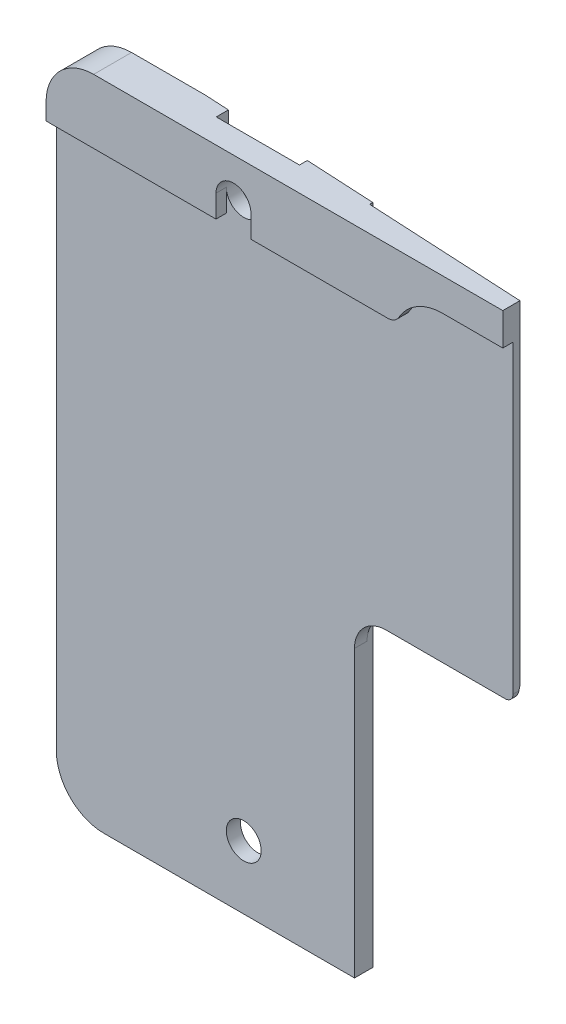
ISO-10303-21;
HEADER;
FILE_DESCRIPTION(('STEP AP214'),'2;1');
FILE_NAME('part.step','',(''),(''),'','','');
FILE_SCHEMA(('AUTOMOTIVE_DESIGN { 1 0 10303 214 1 1 1 1 }'));
ENDSEC;
DATA;
#1=APPLICATION_CONTEXT('core data for automotive mechanical design processes');
#2=APPLICATION_PROTOCOL_DEFINITION('international standard','automotive_design',2000,#1);
#3=PRODUCT_CONTEXT('',#1,'mechanical');
#4=PRODUCT('Part','Part','',(#3));
#5=PRODUCT_RELATED_PRODUCT_CATEGORY('part','',(#4));
#6=PRODUCT_DEFINITION_FORMATION('','',#4);
#7=PRODUCT_DEFINITION_CONTEXT('part definition',#1,'design');
#8=PRODUCT_DEFINITION('design','',#6,#7);
#9=PRODUCT_DEFINITION_SHAPE('','',#8);
#10=(LENGTH_UNIT() NAMED_UNIT(*) SI_UNIT(.MILLI.,.METRE.));
#11=(NAMED_UNIT(*) PLANE_ANGLE_UNIT() SI_UNIT($,.RADIAN.));
#12=(NAMED_UNIT(*) SI_UNIT($,.STERADIAN.) SOLID_ANGLE_UNIT());
#13=UNCERTAINTY_MEASURE_WITH_UNIT(LENGTH_MEASURE(1.E-05),#10,'distance_accuracy_value','');
#14=(GEOMETRIC_REPRESENTATION_CONTEXT(3) GLOBAL_UNCERTAINTY_ASSIGNED_CONTEXT((#13)) GLOBAL_UNIT_ASSIGNED_CONTEXT((#10,
#11,#12)) REPRESENTATION_CONTEXT('',''));
#15=CARTESIAN_POINT('',(0.,0.,0.));
#16=DIRECTION('',(0.,0.,1.));
#17=DIRECTION('',(1.,0.,0.));
#18=AXIS2_PLACEMENT_3D('',#15,#16,#17);
#19=CARTESIAN_POINT('',(0.,-58.4170608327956,-4.31));
#20=DIRECTION('',(0.,1.,0.));
#21=DIRECTION('',(0.,0.,1.));
#22=AXIS2_PLACEMENT_3D('',#19,#20,#21);
#23=PLANE('',#22);
#24=DIRECTION('',(1.,0.,0.));
#25=VECTOR('',#24,1.);
#26=CARTESIAN_POINT('',(0.,-58.4170608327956,-4.96));
#27=LINE('',#26,#25);
#28=CARTESIAN_POINT('',(13.115,-58.4170608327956,-4.96));
#29=VERTEX_POINT('',#28);
#30=CARTESIAN_POINT('',(21.7499385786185,-58.4170608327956,-4.96));
#31=VERTEX_POINT('',#30);
#32=EDGE_CURVE('E327',#29,#31,#27,.T.);
#33=ORIENTED_EDGE('',*,*,#32,.T.);
#34=DIRECTION('',(0.,0.,-1.));
#35=VECTOR('',#34,1.);
#36=CARTESIAN_POINT('',(21.7499385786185,-58.4170608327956,-4.31));
#37=LINE('',#36,#35);
#38=CARTESIAN_POINT('',(21.7499385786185,-58.4170608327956,-4.31));
#39=VERTEX_POINT('',#38);
#40=EDGE_CURVE('E54',#31,#39,#37,.F.);
#41=ORIENTED_EDGE('',*,*,#40,.T.);
#42=DIRECTION('',(1.,0.,0.));
#43=VECTOR('',#42,1.);
#44=CARTESIAN_POINT('',(0.,-58.4170608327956,-4.31));
#45=LINE('',#44,#43);
#46=CARTESIAN_POINT('',(13.115,-58.4170608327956,-4.31));
#47=VERTEX_POINT('',#46);
#48=EDGE_CURVE('E330',#47,#39,#45,.T.);
#49=ORIENTED_EDGE('',*,*,#48,.F.);
#50=DIRECTION('',(0.,0.,1.));
#51=VECTOR('',#50,1.);
#52=CARTESIAN_POINT('',(13.115,-58.4170608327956,-8.30299195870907));
#53=LINE('',#52,#51);
#54=EDGE_CURVE('E522',#29,#47,#53,.T.);
#55=ORIENTED_EDGE('',*,*,#54,.F.);
#56=EDGE_LOOP('',(#33,#41,#49,#55));
#57=FACE_BOUND('',#56,.T.);
#58=ADVANCED_FACE('F34',(#57),#23,.F.);
#59=CARTESIAN_POINT('',(0.,-128.652153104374,-6.7));
#60=DIRECTION('',(0.,0.,-1.));
#61=DIRECTION('',(-1.,0.,0.));
#62=AXIS2_PLACEMENT_3D('',#59,#60,#61);
#63=PLANE('',#62);
#64=CARTESIAN_POINT('',(3.2,-57.3698033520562,-6.7));
#65=DIRECTION('',(0.,0.,1.));
#66=DIRECTION('',(1.,0.,0.));
#67=AXIS2_PLACEMENT_3D('',#64,#65,#66);
#68=CIRCLE('',#67,3.);
#69=CARTESIAN_POINT('',(3.2,-54.3698033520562,-6.7));
#70=VERTEX_POINT('',#69);
#71=CARTESIAN_POINT('',(0.200000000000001,-57.3698033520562,-6.7));
#72=VERTEX_POINT('',#71);
#73=EDGE_CURVE('E279',#70,#72,#68,.T.);
#74=ORIENTED_EDGE('',*,*,#73,.F.);
#75=DIRECTION('',(-1.,0.,0.));
#76=VECTOR('',#75,1.);
#77=CARTESIAN_POINT('',(3.2,-54.3698033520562,-6.7));
#78=LINE('',#77,#76);
#79=CARTESIAN_POINT('',(7.83491967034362,-54.3698033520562,-6.70000000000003));
#80=VERTEX_POINT('',#79);
#81=EDGE_CURVE('E290',#80,#70,#78,.T.);
#82=ORIENTED_EDGE('',*,*,#81,.F.);
#83=DIRECTION('',(0.,1.,0.));
#84=VECTOR('',#83,1.);
#85=CARTESIAN_POINT('',(7.8349196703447,-128.652153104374,-6.7));
#86=LINE('',#85,#84);
#87=CARTESIAN_POINT('',(7.83491967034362,-96.145,-6.70000000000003));
#88=VERTEX_POINT('',#87);
#89=EDGE_CURVE('E344',#88,#80,#86,.T.);
#90=ORIENTED_EDGE('',*,*,#89,.F.);
#91=DIRECTION('',(1.,0.,0.));
#92=VECTOR('',#91,1.);
#93=CARTESIAN_POINT('',(3.2,-96.145,-6.7));
#94=LINE('',#93,#92);
#95=CARTESIAN_POINT('',(3.2,-96.145,-6.7));
#96=VERTEX_POINT('',#95);
#97=EDGE_CURVE('E288',#96,#88,#94,.T.);
#98=ORIENTED_EDGE('',*,*,#97,.F.);
#99=CARTESIAN_POINT('',(3.2,-93.145,-6.7));
#100=DIRECTION('',(0.,0.,1.));
#101=DIRECTION('',(-1.,0.,0.));
#102=AXIS2_PLACEMENT_3D('',#99,#100,#101);
#103=CIRCLE('',#102,3.);
#104=CARTESIAN_POINT('',(0.200000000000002,-93.145,-6.7));
#105=VERTEX_POINT('',#104);
#106=EDGE_CURVE('E285',#105,#96,#103,.T.);
#107=ORIENTED_EDGE('',*,*,#106,.F.);
#108=DIRECTION('',(0.,-1.,0.));
#109=VECTOR('',#108,1.);
#110=CARTESIAN_POINT('',(0.200000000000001,-93.145,-6.7));
#111=LINE('',#110,#109);
#112=EDGE_CURVE('E282',#72,#105,#111,.T.);
#113=ORIENTED_EDGE('',*,*,#112,.F.);
#114=EDGE_LOOP('',(#74,#82,#90,#98,#107,#113));
#115=FACE_BOUND('',#114,.T.);
#116=ADVANCED_FACE('F496',(#115),#63,.T.);
#117=CARTESIAN_POINT('',(19.,-128.652153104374,-6.11486293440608));
#118=DIRECTION('',(0.0523359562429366,0.,-0.998629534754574));
#119=DIRECTION('',(-0.998629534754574,0.,-0.0523359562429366));
#120=AXIS2_PLACEMENT_3D('',#117,#118,#119);
#121=PLANE('',#120);
#122=CARTESIAN_POINT('',(12.015,-92.145,-6.48093127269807));
#123=DIRECTION('',(0.0523359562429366,0.,-0.998629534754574));
#124=DIRECTION('',(-0.998629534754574,0.,-0.0523359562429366));
#125=AXIS2_PLACEMENT_3D('',#122,#123,#124);
#126=ELLIPSE('',#125,2.62860240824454,2.625);
#127=CARTESIAN_POINT('',(9.39000000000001,-92.145,-6.61850169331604));
#128=VERTEX_POINT('',#127);
#129=EDGE_CURVE('E278',#128,#128,#126,.T.);
#130=ORIENTED_EDGE('',*,*,#129,.F.);
#131=EDGE_LOOP('',(#130));
#132=FACE_BOUND('',#131,.T.);
#133=DIRECTION('',(0.,-1.,0.));
#134=VECTOR('',#133,1.);
#135=CARTESIAN_POINT('',(14.64,-128.652153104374,-6.34336085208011));
#136=LINE('',#135,#134);
#137=CARTESIAN_POINT('',(14.64,-54.3698033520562,-6.34336085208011));
#138=VERTEX_POINT('',#137);
#139=CARTESIAN_POINT('',(14.64,-57.,-6.34336085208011));
#140=VERTEX_POINT('',#139);
#141=EDGE_CURVE('E276',#138,#140,#136,.T.);
#142=ORIENTED_EDGE('',*,*,#141,.F.);
#143=DIRECTION('',(0.998629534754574,0.,0.0523359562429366));
#144=VECTOR('',#143,1.);
#145=CARTESIAN_POINT('',(19.,-54.3698033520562,-6.11486293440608));
#146=LINE('',#145,#144);
#147=CARTESIAN_POINT('',(19.,-54.3698033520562,-6.11486293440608));
#148=VERTEX_POINT('',#147);
#149=EDGE_CURVE('E320',#138,#148,#146,.T.);
#150=ORIENTED_EDGE('',*,*,#149,.T.);
#151=DIRECTION('',(0.,1.,0.));
#152=VECTOR('',#151,1.);
#153=CARTESIAN_POINT('',(19.,-128.652153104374,-6.11486293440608));
#154=LINE('',#153,#152);
#155=CARTESIAN_POINT('',(19.,-96.145,-6.11486293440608));
#156=VERTEX_POINT('',#155);
#157=EDGE_CURVE('E348',#156,#148,#154,.T.);
#158=ORIENTED_EDGE('',*,*,#157,.F.);
#159=DIRECTION('',(-0.998629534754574,0.,-0.0523359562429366));
#160=VECTOR('',#159,1.);
#161=CARTESIAN_POINT('',(19.,-96.145,-6.11486293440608));
#162=LINE('',#161,#160);
#163=EDGE_CURVE('E324',#156,#88,#162,.T.);
#164=ORIENTED_EDGE('',*,*,#163,.T.);
#165=ORIENTED_EDGE('',*,*,#89,.T.);
#166=CARTESIAN_POINT('',(9.39000000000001,-54.3698033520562,-6.61850169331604));
#167=VERTEX_POINT('',#166);
#168=EDGE_CURVE('E321',#80,#167,#146,.T.);
#169=ORIENTED_EDGE('',*,*,#168,.T.);
#170=DIRECTION('',(0.,1.,0.));
#171=VECTOR('',#170,1.);
#172=CARTESIAN_POINT('',(9.39000000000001,-128.652153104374,-6.61850169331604));
#173=LINE('',#172,#171);
#174=CARTESIAN_POINT('',(9.39000000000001,-57.,-6.61850169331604));
#175=VERTEX_POINT('',#174);
#176=EDGE_CURVE('E254',#175,#167,#173,.T.);
#177=ORIENTED_EDGE('',*,*,#176,.F.);
#178=CARTESIAN_POINT('',(12.015,-57.,-6.48093127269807));
#179=DIRECTION('',(0.0523359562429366,0.,-0.998629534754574));
#180=DIRECTION('',(-0.998629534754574,0.,-0.0523359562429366));
#181=AXIS2_PLACEMENT_3D('',#178,#179,#180);
#182=ELLIPSE('',#181,2.62860240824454,2.625);
#183=EDGE_CURVE('E570',#140,#175,#182,.T.);
#184=ORIENTED_EDGE('',*,*,#183,.F.);
#185=EDGE_LOOP('',(#142,#150,#158,#164,#165,#169,#177,#184));
#186=FACE_BOUND('',#185,.T.);
#187=ADVANCED_FACE('F501',(#132,#186),#121,.T.);
#188=CARTESIAN_POINT('',(19.,-128.652153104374,-6.11486293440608));
#189=DIRECTION('',(1.,0.,0.));
#190=DIRECTION('',(0.,0.,-1.));
#191=AXIS2_PLACEMENT_3D('',#188,#189,#190);
#192=PLANE('',#191);
#193=DIRECTION('',(0.,1.,0.));
#194=VECTOR('',#193,1.);
#195=CARTESIAN_POINT('',(19.,-128.652153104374,-5.9145884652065));
#196=LINE('',#195,#194);
#197=CARTESIAN_POINT('',(19.,-76.2739600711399,-5.9145884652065));
#198=VERTEX_POINT('',#197);
#199=CARTESIAN_POINT('',(19.,-54.3698033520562,-5.9145884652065));
#200=VERTEX_POINT('',#199);
#201=EDGE_CURVE('E351',#198,#200,#196,.T.);
#202=ORIENTED_EDGE('',*,*,#201,.F.);
#203=CARTESIAN_POINT('',(19.,-78.1450000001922,-5.75343244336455));
#204=CARTESIAN_POINT('',(19.0000017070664,-78.1188909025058,-5.75343222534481));
#205=CARTESIAN_POINT('',(19.0000035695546,-78.0927818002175,-5.75353385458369));
#206=CARTESIAN_POINT('',(19.0000057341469,-78.0405902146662,-5.75394079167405));
#207=CARTESIAN_POINT('',(19.0000060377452,-78.0145077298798,-5.7542459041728));
#208=CARTESIAN_POINT('',(19.0000032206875,-77.9622888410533,-5.75506068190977));
#209=CARTESIAN_POINT('',(19.0000000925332,-77.9361524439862,-5.75557079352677));
#210=CARTESIAN_POINT('',(18.9999999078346,-77.8839882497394,-5.75679027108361));
#211=CARTESIAN_POINT('',(19.0000028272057,-77.8579604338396,-5.75749883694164));
#212=CARTESIAN_POINT('',(19.0000055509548,-77.8058697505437,-5.75911818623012));
#213=CARTESIAN_POINT('',(19.0000053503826,-77.779806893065,-5.76002928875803));
#214=CARTESIAN_POINT('',(19.0000026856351,-77.7275737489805,-5.76205566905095));
#215=CARTESIAN_POINT('',(19.0000002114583,-77.7014034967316,-5.76317183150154));
#216=CARTESIAN_POINT('',(18.9999997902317,-77.6492813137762,-5.76559232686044));
#217=CARTESIAN_POINT('',(19.0000018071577,-77.623329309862,-5.7668950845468));
#218=CARTESIAN_POINT('',(19.0000036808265,-77.5713316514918,-5.76970012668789));
#219=CARTESIAN_POINT('',(19.0000035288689,-77.5452860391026,-5.77120319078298));
#220=CARTESIAN_POINT('',(19.0000017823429,-77.4930425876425,-5.77441186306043));
#221=CARTESIAN_POINT('',(19.0000001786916,-77.4668448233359,-5.7761186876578));
#222=CARTESIAN_POINT('',(18.9999998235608,-77.4147925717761,-5.77970025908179));
#223=CARTESIAN_POINT('',(19.0000010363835,-77.3889379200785,-5.78157261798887));
#224=CARTESIAN_POINT('',(19.0000021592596,-77.3370660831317,-5.78551386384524));
#225=CARTESIAN_POINT('',(19.000002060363,-77.3110489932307,-5.78758400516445));
#226=CARTESIAN_POINT('',(19.0000010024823,-77.2588082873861,-5.79192416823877));
#227=CARTESIAN_POINT('',(19.0000000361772,-77.2325848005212,-5.79419574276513));
#228=CARTESIAN_POINT('',(18.9999999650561,-77.1810476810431,-5.79883789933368));
#229=CARTESIAN_POINT('',(19.000000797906,-77.1557335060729,-5.80120246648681));
#230=CARTESIAN_POINT('',(19.000002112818,-77.1048872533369,-5.80611764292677));
#231=CARTESIAN_POINT('',(19.0000025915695,-77.0793553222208,-5.80866976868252));
#232=CARTESIAN_POINT('',(19.000002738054,-77.0280438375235,-5.8139630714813));
#233=CARTESIAN_POINT('',(19.0000023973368,-77.002264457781,-5.81670593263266));
#234=CARTESIAN_POINT('',(19.0000016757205,-76.9504309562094,-5.82238360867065));
#235=CARTESIAN_POINT('',(19.0000012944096,-76.9243770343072,-5.82532024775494));
#236=CARTESIAN_POINT('',(19.0000006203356,-76.8719694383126,-5.83138836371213));
#237=CARTESIAN_POINT('',(19.0000003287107,-76.8456159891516,-5.83452178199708));
#238=CARTESIAN_POINT('',(19.0000002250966,-76.7925863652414,-5.84098611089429));
#239=CARTESIAN_POINT('',(19.0000004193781,-76.7659104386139,-5.84431905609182));
#240=CARTESIAN_POINT('',(18.9999996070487,-76.7142586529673,-5.85092422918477));
#241=CARTESIAN_POINT('',(18.9999986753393,-76.6892815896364,-5.85418704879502));
#242=CARTESIAN_POINT('',(18.999996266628,-76.6389958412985,-5.86088940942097));
#243=CARTESIAN_POINT('',(18.9999947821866,-76.6136874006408,-5.86433078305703));
#244=CARTESIAN_POINT('',(18.9999927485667,-76.5627247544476,-5.87139206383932));
#245=CARTESIAN_POINT('',(18.9999922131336,-76.5370708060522,-5.87501382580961));
#246=CARTESIAN_POINT('',(18.9999922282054,-76.4854043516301,-5.88243776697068));
#247=CARTESIAN_POINT('',(18.9999927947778,-76.4593921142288,-5.88624181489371));
#248=CARTESIAN_POINT('',(18.999994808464,-76.4069978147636,-5.89403207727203));
#249=CARTESIAN_POINT('',(18.9999962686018,-76.380616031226,-5.89802016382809));
#250=CARTESIAN_POINT('',(18.9999987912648,-76.3274728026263,-5.90618027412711));
#251=CARTESIAN_POINT('',(18.9999998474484,-76.3007116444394,-5.91035416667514));
#252=CARTESIAN_POINT('',(19.0000000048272,-76.2739600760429,-5.91458846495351));
#253=B_SPLINE_CURVE_WITH_KNOTS('',3,(#203,#204,#205,#206,#207,#208,#209,#210,#211,#212,#213,
#214,#215,#216,#217,#218,#219,#220,#221,#222,#223,#224,#225,#226,#227,#228,#229,#230,#231,#232,
#233,#234,#235,#236,#237,#238,#239,#240,#241,#242,#243,#244,#245,#246,#247,#248,#249,#250,#251,
#252),.UNSPECIFIED.,.F.,.F.,(4,2,2,2,2,2,2,2,2,2,2,2,2,2,2,2,2,2,2,2,2,2,2,2,4),(0.,
0.0783271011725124,0.156579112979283,0.235002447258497,0.313114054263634,0.391349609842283,
0.469930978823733,0.547884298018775,0.626150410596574,0.704909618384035,0.782676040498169,
0.860973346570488,0.939937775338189,1.01621034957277,1.09318731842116,1.17096146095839,
1.24961765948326,1.32923440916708,1.40988393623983,1.48545141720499,1.56207510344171,
1.63979980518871,1.71866624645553,1.79871050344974,1.87996428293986),.UNSPECIFIED.);
#254=CARTESIAN_POINT('',(19.,-78.145,-5.75343169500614));
#255=VERTEX_POINT('',#254);
#256=EDGE_CURVE('E425',#198,#255,#253,.F.);
#257=ORIENTED_EDGE('',*,*,#256,.T.);
#258=DIRECTION('',(0.,0.,1.));
#259=VECTOR('',#258,1.);
#260=CARTESIAN_POINT('',(19.,-78.145,-4.96));
#261=LINE('',#260,#259);
#262=CARTESIAN_POINT('',(19.,-78.145,-4.96));
#263=VERTEX_POINT('',#262);
#264=EDGE_CURVE('E581',#255,#263,#261,.T.);
#265=ORIENTED_EDGE('',*,*,#264,.T.);
#266=DIRECTION('',(0.,1.,0.));
#267=VECTOR('',#266,1.);
#268=CARTESIAN_POINT('',(19.,-128.652153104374,-4.96));
#269=LINE('',#268,#267);
#270=CARTESIAN_POINT('',(19.,-96.145,-4.96));
#271=VERTEX_POINT('',#270);
#272=EDGE_CURVE('E571',#271,#263,#269,.T.);
#273=ORIENTED_EDGE('',*,*,#272,.F.);
#274=DIRECTION('',(0.,0.,1.));
#275=VECTOR('',#274,1.);
#276=CARTESIAN_POINT('',(19.,-96.145,-6.7));
#277=LINE('',#276,#275);
#278=EDGE_CURVE('E300',#156,#271,#277,.T.);
#279=ORIENTED_EDGE('',*,*,#278,.F.);
#280=ORIENTED_EDGE('',*,*,#157,.T.);
#281=DIRECTION('',(0.,0.,1.));
#282=VECTOR('',#281,1.);
#283=CARTESIAN_POINT('',(19.,-54.3698033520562,-6.11486293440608));
#284=LINE('',#283,#282);
#285=EDGE_CURVE('E317',#148,#200,#284,.T.);
#286=ORIENTED_EDGE('',*,*,#285,.T.);
#287=EDGE_LOOP('',(#202,#257,#265,#273,#279,#280,#286));
#288=FACE_BOUND('',#287,.T.);
#289=ADVANCED_FACE('F384',(#288),#192,.T.);
#290=CARTESIAN_POINT('',(19.,-128.652153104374,-5.9145884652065));
#291=DIRECTION('',(0.0523359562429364,0.,-0.998629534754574));
#292=DIRECTION('',(-0.998629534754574,0.,-0.0523359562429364));
#293=AXIS2_PLACEMENT_3D('',#290,#291,#292);
#294=PLANE('',#293);
#295=DIRECTION('',(-0.998629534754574,0.,-0.0523359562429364));
#296=VECTOR('',#295,1.);
#297=CARTESIAN_POINT('',(19.,-75.3985898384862,-5.9145884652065));
#298=LINE('',#297,#296);
#299=CARTESIAN_POINT('',(29.,-75.3985898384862,-5.39051067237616));
#300=VERTEX_POINT('',#299);
#301=CARTESIAN_POINT('',(21.0104671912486,-75.3985898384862,-5.80922434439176));
#302=VERTEX_POINT('',#301);
#303=EDGE_CURVE('E371',#300,#302,#298,.T.);
#304=ORIENTED_EDGE('',*,*,#303,.T.);
#305=CARTESIAN_POINT('',(18.2725232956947,-78.3604808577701,-5.95271390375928));
#306=CARTESIAN_POINT('',(18.2577001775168,-78.172322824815,-5.95349075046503));
#307=CARTESIAN_POINT('',(18.2623719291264,-77.9826397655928,-5.95324591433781));
#308=CARTESIAN_POINT('',(18.2984056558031,-77.701831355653,-5.95135746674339));
#309=CARTESIAN_POINT('',(18.3152460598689,-77.6088493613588,-5.95047489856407));
#310=CARTESIAN_POINT('',(18.358405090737,-77.4251103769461,-5.94821302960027));
#311=CARTESIAN_POINT('',(18.3847238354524,-77.3343544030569,-5.94683372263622));
#312=CARTESIAN_POINT('',(18.4465606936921,-77.1560318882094,-5.94359299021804));
#313=CARTESIAN_POINT('',(18.482078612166,-77.068465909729,-5.94173157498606));
#314=CARTESIAN_POINT('',(18.5619367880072,-76.8974530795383,-5.93754638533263));
#315=CARTESIAN_POINT('',(18.60627679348,-76.8140067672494,-5.93522262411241));
#316=CARTESIAN_POINT('',(18.7033084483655,-76.6521192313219,-5.9301374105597));
#317=CARTESIAN_POINT('',(18.7559997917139,-76.5736785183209,-5.92737597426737));
#318=CARTESIAN_POINT('',(18.869174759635,-76.4226350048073,-5.92144472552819));
#319=CARTESIAN_POINT('',(18.929658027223,-76.3500326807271,-5.91827493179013));
#320=CARTESIAN_POINT('',(19.0577747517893,-76.2114367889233,-5.91156061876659));
#321=CARTESIAN_POINT('',(19.1254078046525,-76.145443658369,-5.9080161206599));
#322=CARTESIAN_POINT('',(19.2671060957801,-76.0207668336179,-5.9005900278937));
#323=CARTESIAN_POINT('',(19.3411708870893,-75.9620835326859,-5.89670845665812));
#324=CARTESIAN_POINT('',(19.4949463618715,-75.8526494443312,-5.8886494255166));
#325=CARTESIAN_POINT('',(19.5746565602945,-75.8018990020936,-5.88447199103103));
#326=CARTESIAN_POINT('',(19.7388766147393,-75.7088694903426,-5.87586558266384));
#327=CARTESIAN_POINT('',(19.8233859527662,-75.6665907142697,-5.87143663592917));
#328=CARTESIAN_POINT('',(19.9963070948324,-75.5909534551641,-5.8623742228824));
#329=CARTESIAN_POINT('',(20.0847183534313,-75.557595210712,-5.85774078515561));
#330=CARTESIAN_POINT('',(20.2645047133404,-75.5001532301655,-5.8483185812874));
#331=CARTESIAN_POINT('',(20.3558787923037,-75.4760694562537,-5.8435298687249));
#332=CARTESIAN_POINT('',(20.632994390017,-75.4181148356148,-5.82900685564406));
#333=CARTESIAN_POINT('',(20.8217261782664,-75.3985751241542,-5.81911584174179));
#334=CARTESIAN_POINT('',(21.0104671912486,-75.3985898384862,-5.80922434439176));
#335=B_SPLINE_CURVE_WITH_KNOTS('',3,(#305,#306,#307,#308,#309,#310,#311,#312,#313,#314,#315,
#316,#317,#318,#319,#320,#321,#322,#323,#324,#325,#326,#327,#328,#329,#330,#331,#332,#333,#334),
.UNSPECIFIED.,.F.,.F.,(4,2,2,2,2,2,2,2,2,2,2,2,2,2,4),(-0.0785398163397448,0.127627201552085,
0.230710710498,0.333794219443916,0.436877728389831,0.539961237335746,0.643044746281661,
0.746128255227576,0.849211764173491,0.952295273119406,1.05537878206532,1.15846229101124,
1.26154579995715,1.36462930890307,1.5707963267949),.UNSPECIFIED.);
#336=EDGE_CURVE('E365',#302,#198,#335,.F.);
#337=ORIENTED_EDGE('',*,*,#336,.T.);
#338=ORIENTED_EDGE('',*,*,#201,.T.);
#339=DIRECTION('',(0.998629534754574,0.,0.0523359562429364));
#340=VECTOR('',#339,1.);
#341=CARTESIAN_POINT('',(19.,-54.3698033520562,-5.9145884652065));
#342=LINE('',#341,#340);
#343=CARTESIAN_POINT('',(29.,-54.3698033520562,-5.39051067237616));
#344=VERTEX_POINT('',#343);
#345=EDGE_CURVE('E314',#200,#344,#342,.T.);
#346=ORIENTED_EDGE('',*,*,#345,.T.);
#347=DIRECTION('',(0.,1.,0.));
#348=VECTOR('',#347,1.);
#349=CARTESIAN_POINT('',(29.,-128.652153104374,-5.39051067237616));
#350=LINE('',#349,#348);
#351=EDGE_CURVE('E354',#300,#344,#350,.T.);
#352=ORIENTED_EDGE('',*,*,#351,.F.);
#353=EDGE_LOOP('',(#304,#337,#338,#346,#352));
#354=FACE_BOUND('',#353,.T.);
#355=ADVANCED_FACE('F373',(#354),#294,.T.);
#356=CARTESIAN_POINT('',(29.,-128.652153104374,-4.96));
#357=DIRECTION('',(1.,0.,0.));
#358=DIRECTION('',(0.,0.,-1.));
#359=AXIS2_PLACEMENT_3D('',#356,#357,#358);
#360=PLANE('',#359);
#361=DIRECTION('',(0.,1.,0.));
#362=VECTOR('',#361,1.);
#363=CARTESIAN_POINT('',(29.,-128.652153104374,-4.96));
#364=LINE('',#363,#362);
#365=CARTESIAN_POINT('',(29.,-75.645,-4.96));
#366=VERTEX_POINT('',#365);
#367=CARTESIAN_POINT('',(29.,-56.4170608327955,-4.96));
#368=VERTEX_POINT('',#367);
#369=EDGE_CURVE('E343',#366,#368,#364,.T.);
#370=ORIENTED_EDGE('',*,*,#369,.F.);
#371=DIRECTION('',(0.,0.,1.));
#372=VECTOR('',#371,1.);
#373=CARTESIAN_POINT('',(29.,-75.645,-4.96));
#374=LINE('',#373,#372);
#375=CARTESIAN_POINT('',(29.,-75.645,-5.32439465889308));
#376=VERTEX_POINT('',#375);
#377=EDGE_CURVE('E544',#366,#376,#374,.F.);
#378=ORIENTED_EDGE('',*,*,#377,.T.);
#379=DIRECTION('',(0.,-0.965836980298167,0.259150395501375));
#380=VECTOR('',#379,1.);
#381=CARTESIAN_POINT('',(29.,-125.183456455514,7.96761097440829));
#382=LINE('',#381,#380);
#383=EDGE_CURVE('E420',#376,#300,#382,.F.);
#384=ORIENTED_EDGE('',*,*,#383,.T.);
#385=ORIENTED_EDGE('',*,*,#351,.T.);
#386=DIRECTION('',(0.,0.,1.));
#387=VECTOR('',#386,1.);
#388=CARTESIAN_POINT('',(29.,-54.3698033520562,-6.7));
#389=LINE('',#388,#387);
#390=CARTESIAN_POINT('',(29.,-54.3698033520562,-4.31));
#391=VERTEX_POINT('',#390);
#392=EDGE_CURVE('E297',#344,#391,#389,.T.);
#393=ORIENTED_EDGE('',*,*,#392,.T.);
#394=DIRECTION('',(0.,1.,0.));
#395=VECTOR('',#394,1.);
#396=CARTESIAN_POINT('',(29.,-52.2,-4.31));
#397=LINE('',#396,#395);
#398=CARTESIAN_POINT('',(29.,-56.4170608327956,-4.31));
#399=VERTEX_POINT('',#398);
#400=EDGE_CURVE('E332',#399,#391,#397,.T.);
#401=ORIENTED_EDGE('',*,*,#400,.F.);
#402=DIRECTION('',(0.,0.,-1.));
#403=VECTOR('',#402,1.);
#404=CARTESIAN_POINT('',(29.,-56.4170608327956,-4.31));
#405=LINE('',#404,#403);
#406=EDGE_CURVE('E335',#399,#368,#405,.T.);
#407=ORIENTED_EDGE('',*,*,#406,.T.);
#408=EDGE_LOOP('',(#370,#378,#384,#385,#393,#401,#407));
#409=FACE_BOUND('',#408,.T.);
#410=ADVANCED_FACE('F383',(#409),#360,.T.);
#411=CARTESIAN_POINT('',(0.,-128.652153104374,-4.96));
#412=DIRECTION('',(0.,0.,1.));
#413=DIRECTION('',(1.,0.,0.));
#414=AXIS2_PLACEMENT_3D('',#411,#412,#413);
#415=PLANE('',#414);
#416=CARTESIAN_POINT('',(12.015,-92.145,-4.96));
#417=DIRECTION('',(0.,0.,1.));
#418=DIRECTION('',(1.,0.,0.));
#419=AXIS2_PLACEMENT_3D('',#416,#417,#418);
#420=CIRCLE('',#419,1.1);
#421=CARTESIAN_POINT('',(10.915,-92.145,-4.96));
#422=VERTEX_POINT('',#421);
#423=EDGE_CURVE('E238',#422,#422,#420,.T.);
#424=ORIENTED_EDGE('',*,*,#423,.F.);
#425=EDGE_LOOP('',(#424));
#426=FACE_BOUND('',#425,.T.);
#427=DIRECTION('',(1.,0.,0.));
#428=VECTOR('',#427,1.);
#429=CARTESIAN_POINT('',(22.25,-56.4170608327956,-4.96));
#430=LINE('',#429,#428);
#431=CARTESIAN_POINT('',(25.1995762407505,-56.4170608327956,-4.96));
#432=VERTEX_POINT('',#431);
#433=EDGE_CURVE('E339',#432,#368,#430,.T.);
#434=ORIENTED_EDGE('',*,*,#433,.F.);
#435=CARTESIAN_POINT('',(25.1995762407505,-59.5920608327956,-4.96));
#436=DIRECTION('',(0.,0.,1.));
#437=DIRECTION('',(1.,0.,0.));
#438=AXIS2_PLACEMENT_3D('',#435,#436,#437);
#439=CIRCLE('',#438,3.175);
#440=CARTESIAN_POINT('',(22.4442052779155,-58.0145451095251,-4.96));
#441=VERTEX_POINT('',#440);
#442=EDGE_CURVE('E537',#432,#441,#439,.T.);
#443=ORIENTED_EDGE('',*,*,#442,.T.);
#444=CARTESIAN_POINT('',(21.7499385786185,-57.6170608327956,-4.96));
#445=DIRECTION('',(0.,0.,1.));
#446=DIRECTION('',(1.,0.,0.));
#447=AXIS2_PLACEMENT_3D('',#444,#445,#446);
#448=CIRCLE('',#447,0.8);
#449=EDGE_CURVE('E12',#441,#31,#448,.F.);
#450=ORIENTED_EDGE('',*,*,#449,.T.);
#451=ORIENTED_EDGE('',*,*,#32,.F.);
#452=DIRECTION('',(0.,-1.,0.));
#453=VECTOR('',#452,1.);
#454=CARTESIAN_POINT('',(13.115,-58.4170608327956,-4.96));
#455=LINE('',#454,#453);
#456=CARTESIAN_POINT('',(13.115,-57.,-4.96));
#457=VERTEX_POINT('',#456);
#458=EDGE_CURVE('E518',#457,#29,#455,.T.);
#459=ORIENTED_EDGE('',*,*,#458,.F.);
#460=CARTESIAN_POINT('',(12.015,-57.,-4.96));
#461=DIRECTION('',(0.,0.,1.));
#462=DIRECTION('',(1.,0.,0.));
#463=AXIS2_PLACEMENT_3D('',#460,#461,#462);
#464=CIRCLE('',#463,1.1);
#465=CARTESIAN_POINT('',(10.915,-57.,-4.96));
#466=VERTEX_POINT('',#465);
#467=EDGE_CURVE('E517',#457,#466,#464,.F.);
#468=ORIENTED_EDGE('',*,*,#467,.T.);
#469=DIRECTION('',(0.,1.,0.));
#470=VECTOR('',#469,1.);
#471=CARTESIAN_POINT('',(10.915,-57.,-4.96));
#472=LINE('',#471,#470);
#473=CARTESIAN_POINT('',(10.915,-58.4170608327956,-4.96));
#474=VERTEX_POINT('',#473);
#475=EDGE_CURVE('E216',#474,#466,#472,.T.);
#476=ORIENTED_EDGE('',*,*,#475,.F.);
#477=CARTESIAN_POINT('',(0.200000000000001,-58.4170608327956,-4.96));
#478=VERTEX_POINT('',#477);
#479=EDGE_CURVE('E336',#478,#474,#27,.T.);
#480=ORIENTED_EDGE('',*,*,#479,.F.);
#481=DIRECTION('',(0.,-1.,0.));
#482=VECTOR('',#481,1.);
#483=CARTESIAN_POINT('',(0.200000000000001,-128.652153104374,-4.96));
#484=LINE('',#483,#482);
#485=CARTESIAN_POINT('',(0.200000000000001,-93.145,-4.96));
#486=VERTEX_POINT('',#485);
#487=EDGE_CURVE('E311',#478,#486,#484,.T.);
#488=ORIENTED_EDGE('',*,*,#487,.T.);
#489=CARTESIAN_POINT('',(3.2,-93.145,-4.96));
#490=DIRECTION('',(0.,0.,1.));
#491=DIRECTION('',(1.,0.,0.));
#492=AXIS2_PLACEMENT_3D('',#489,#490,#491);
#493=CIRCLE('',#492,3.);
#494=CARTESIAN_POINT('',(3.2,-96.145,-4.96));
#495=VERTEX_POINT('',#494);
#496=EDGE_CURVE('E855',#486,#495,#493,.T.);
#497=ORIENTED_EDGE('',*,*,#496,.T.);
#498=DIRECTION('',(1.,0.,0.));
#499=VECTOR('',#498,1.);
#500=CARTESIAN_POINT('',(0.,-96.145,-4.96));
#501=LINE('',#500,#499);
#502=EDGE_CURVE('E574',#495,#271,#501,.T.);
#503=ORIENTED_EDGE('',*,*,#502,.T.);
#504=ORIENTED_EDGE('',*,*,#272,.T.);
#505=CARTESIAN_POINT('',(21.,-78.145,-4.96));
#506=DIRECTION('',(0.,0.,1.));
#507=DIRECTION('',(1.,0.,0.));
#508=AXIS2_PLACEMENT_3D('',#505,#506,#507);
#509=CIRCLE('',#508,2.);
#510=CARTESIAN_POINT('',(21.,-76.145,-4.96));
#511=VERTEX_POINT('',#510);
#512=EDGE_CURVE('E359',#263,#511,#509,.F.);
#513=ORIENTED_EDGE('',*,*,#512,.T.);
#514=DIRECTION('',(1.,0.,0.));
#515=VECTOR('',#514,1.);
#516=CARTESIAN_POINT('',(0.,-76.145,-4.96));
#517=LINE('',#516,#515);
#518=CARTESIAN_POINT('',(28.5,-76.145,-4.96));
#519=VERTEX_POINT('',#518);
#520=EDGE_CURVE('E563',#511,#519,#517,.T.);
#521=ORIENTED_EDGE('',*,*,#520,.T.);
#522=CARTESIAN_POINT('',(28.5,-75.645,-4.96));
#523=DIRECTION('',(0.,0.,1.));
#524=DIRECTION('',(1.,0.,0.));
#525=AXIS2_PLACEMENT_3D('',#522,#523,#524);
#526=CIRCLE('',#525,0.5);
#527=EDGE_CURVE('E546',#519,#366,#526,.T.);
#528=ORIENTED_EDGE('',*,*,#527,.T.);
#529=ORIENTED_EDGE('',*,*,#369,.T.);
#530=EDGE_LOOP('',(#434,#443,#450,#451,#459,#468,#476,#480,#488,#497,#503,#504,#513,#521,#528,#529));
#531=FACE_BOUND('',#530,.T.);
#532=ADVANCED_FACE('F389',(#426,#531),#415,.T.);
#533=ORIENTED_EDGE('',*,*,#479,.T.);
#534=DIRECTION('',(0.,0.,1.));
#535=VECTOR('',#534,1.);
#536=CARTESIAN_POINT('',(10.915,-58.4170608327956,-8.30299195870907));
#537=LINE('',#536,#535);
#538=CARTESIAN_POINT('',(10.915,-58.4170608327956,-4.31));
#539=VERTEX_POINT('',#538);
#540=EDGE_CURVE('E220',#474,#539,#537,.T.);
#541=ORIENTED_EDGE('',*,*,#540,.T.);
#542=CARTESIAN_POINT('',(0.200000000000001,-58.4170608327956,-4.31));
#543=VERTEX_POINT('',#542);
#544=EDGE_CURVE('E231',#543,#539,#45,.T.);
#545=ORIENTED_EDGE('',*,*,#544,.F.);
#546=DIRECTION('',(0.,0.,1.));
#547=VECTOR('',#546,1.);
#548=CARTESIAN_POINT('',(0.200000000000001,-58.4170608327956,-4.31));
#549=LINE('',#548,#547);
#550=EDGE_CURVE('E296',#478,#543,#549,.T.);
#551=ORIENTED_EDGE('',*,*,#550,.F.);
#552=EDGE_LOOP('',(#533,#541,#545,#551));
#553=FACE_BOUND('',#552,.T.);
#554=ADVANCED_FACE('F393',(#553),#23,.F.);
#555=CARTESIAN_POINT('',(0.,0.,-4.31));
#556=DIRECTION('',(0.,0.,1.));
#557=DIRECTION('',(1.,0.,0.));
#558=AXIS2_PLACEMENT_3D('',#555,#556,#557);
#559=PLANE('',#558);
#560=ORIENTED_EDGE('',*,*,#48,.T.);
#561=CARTESIAN_POINT('',(21.7499385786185,-57.6170608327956,-4.31));
#562=DIRECTION('',(0.,0.,1.));
#563=DIRECTION('',(1.,0.,0.));
#564=AXIS2_PLACEMENT_3D('',#561,#562,#563);
#565=CIRCLE('',#564,0.8);
#566=CARTESIAN_POINT('',(22.4442052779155,-58.0145451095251,-4.31));
#567=VERTEX_POINT('',#566);
#568=EDGE_CURVE('E42',#39,#567,#565,.T.);
#569=ORIENTED_EDGE('',*,*,#568,.T.);
#570=CARTESIAN_POINT('',(25.1995762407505,-59.5920608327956,-4.31));
#571=DIRECTION('',(0.,0.,1.));
#572=DIRECTION('',(1.,0.,0.));
#573=AXIS2_PLACEMENT_3D('',#570,#571,#572);
#574=CIRCLE('',#573,3.175);
#575=CARTESIAN_POINT('',(25.1995762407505,-56.4170608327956,-4.31));
#576=VERTEX_POINT('',#575);
#577=EDGE_CURVE('E535',#567,#576,#574,.F.);
#578=ORIENTED_EDGE('',*,*,#577,.T.);
#579=DIRECTION('',(1.,0.,0.));
#580=VECTOR('',#579,1.);
#581=CARTESIAN_POINT('',(22.25,-56.4170608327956,-4.31));
#582=LINE('',#581,#580);
#583=EDGE_CURVE('E329',#576,#399,#582,.T.);
#584=ORIENTED_EDGE('',*,*,#583,.T.);
#585=ORIENTED_EDGE('',*,*,#400,.T.);
#586=DIRECTION('',(-1.,0.,0.));
#587=VECTOR('',#586,1.);
#588=CARTESIAN_POINT('',(0.,-54.3698033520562,-4.31));
#589=LINE('',#588,#587);
#590=CARTESIAN_POINT('',(3.2,-54.3698033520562,-4.31));
#591=VERTEX_POINT('',#590);
#592=EDGE_CURVE('E853',#391,#591,#589,.T.);
#593=ORIENTED_EDGE('',*,*,#592,.T.);
#594=CARTESIAN_POINT('',(3.2,-57.3698033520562,-4.31));
#595=DIRECTION('',(0.,0.,1.));
#596=DIRECTION('',(1.,0.,0.));
#597=AXIS2_PLACEMENT_3D('',#594,#595,#596);
#598=CIRCLE('',#597,3.);
#599=CARTESIAN_POINT('',(0.200000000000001,-57.3698033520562,-4.31));
#600=VERTEX_POINT('',#599);
#601=EDGE_CURVE('E852',#591,#600,#598,.T.);
#602=ORIENTED_EDGE('',*,*,#601,.T.);
#603=DIRECTION('',(0.,-1.,0.));
#604=VECTOR('',#603,1.);
#605=CARTESIAN_POINT('',(0.200000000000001,0.,-4.31));
#606=LINE('',#605,#604);
#607=EDGE_CURVE('E347',#600,#543,#606,.T.);
#608=ORIENTED_EDGE('',*,*,#607,.T.);
#609=ORIENTED_EDGE('',*,*,#544,.T.);
#610=DIRECTION('',(0.,-1.,0.));
#611=VECTOR('',#610,1.);
#612=CARTESIAN_POINT('',(10.915,-57.,-4.31));
#613=LINE('',#612,#611);
#614=CARTESIAN_POINT('',(10.915,-57.,-4.31));
#615=VERTEX_POINT('',#614);
#616=EDGE_CURVE('E213',#615,#539,#613,.T.);
#617=ORIENTED_EDGE('',*,*,#616,.F.);
#618=CARTESIAN_POINT('',(12.015,-57.,-4.31));
#619=DIRECTION('',(0.,0.,-1.));
#620=DIRECTION('',(-1.,0.,0.));
#621=AXIS2_PLACEMENT_3D('',#618,#619,#620);
#622=CIRCLE('',#621,1.1);
#623=CARTESIAN_POINT('',(13.115,-57.,-4.31));
#624=VERTEX_POINT('',#623);
#625=EDGE_CURVE('E228',#615,#624,#622,.T.);
#626=ORIENTED_EDGE('',*,*,#625,.T.);
#627=DIRECTION('',(0.,1.,0.));
#628=VECTOR('',#627,1.);
#629=CARTESIAN_POINT('',(13.115,-58.4170608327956,-4.31));
#630=LINE('',#629,#628);
#631=EDGE_CURVE('E221',#47,#624,#630,.T.);
#632=ORIENTED_EDGE('',*,*,#631,.F.);
#633=EDGE_LOOP('',(#560,#569,#578,#584,#585,#593,#602,#608,#609,#617,#626,#632));
#634=FACE_BOUND('',#633,.T.);
#635=ADVANCED_FACE('F226',(#634),#559,.T.);
#636=CARTESIAN_POINT('',(22.25,-56.4170608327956,-4.31));
#637=DIRECTION('',(0.,1.,0.));
#638=DIRECTION('',(0.,0.,1.));
#639=AXIS2_PLACEMENT_3D('',#636,#637,#638);
#640=PLANE('',#639);
#641=ORIENTED_EDGE('',*,*,#583,.F.);
#642=DIRECTION('',(0.,0.,-1.));
#643=VECTOR('',#642,1.);
#644=CARTESIAN_POINT('',(25.1995762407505,-56.4170608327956,-4.31));
#645=LINE('',#644,#643);
#646=EDGE_CURVE('E539',#576,#432,#645,.T.);
#647=ORIENTED_EDGE('',*,*,#646,.T.);
#648=ORIENTED_EDGE('',*,*,#433,.T.);
#649=ORIENTED_EDGE('',*,*,#406,.F.);
#650=EDGE_LOOP('',(#641,#647,#648,#649));
#651=FACE_BOUND('',#650,.T.);
#652=ADVANCED_FACE('F510',(#651),#640,.F.);
#653=CARTESIAN_POINT('',(3.2,-57.3698033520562,-6.7));
#654=DIRECTION('',(0.,0.,1.));
#655=DIRECTION('',(1.,0.,0.));
#656=AXIS2_PLACEMENT_3D('',#653,#654,#655);
#657=CYLINDRICAL_SURFACE('',#656,3.);
#658=DIRECTION('',(0.,0.,1.));
#659=VECTOR('',#658,1.);
#660=CARTESIAN_POINT('',(3.2,-54.3698033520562,-6.7));
#661=LINE('',#660,#659);
#662=EDGE_CURVE('E293',#70,#591,#661,.T.);
#663=ORIENTED_EDGE('',*,*,#662,.F.);
#664=ORIENTED_EDGE('',*,*,#73,.T.);
#665=DIRECTION('',(0.,0.,1.));
#666=VECTOR('',#665,1.);
#667=CARTESIAN_POINT('',(0.200000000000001,-57.3698033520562,-6.7));
#668=LINE('',#667,#666);
#669=EDGE_CURVE('E292',#72,#600,#668,.T.);
#670=ORIENTED_EDGE('',*,*,#669,.T.);
#671=ORIENTED_EDGE('',*,*,#601,.F.);
#672=EDGE_LOOP('',(#663,#664,#670,#671));
#673=FACE_BOUND('',#672,.T.);
#674=ADVANCED_FACE('F611',(#673),#657,.T.);
#675=CARTESIAN_POINT('',(3.2,-54.3698033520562,-6.7));
#676=DIRECTION('',(0.,1.,0.));
#677=DIRECTION('',(0.,0.,1.));
#678=AXIS2_PLACEMENT_3D('',#675,#676,#677);
#679=PLANE('',#678);
#680=DIRECTION('',(0.,0.,-1.));
#681=VECTOR('',#680,1.);
#682=CARTESIAN_POINT('',(14.64,-54.3698033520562,-5.85));
#683=LINE('',#682,#681);
#684=CARTESIAN_POINT('',(14.64,-54.3698033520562,-5.85));
#685=VERTEX_POINT('',#684);
#686=EDGE_CURVE('E268',#685,#138,#683,.T.);
#687=ORIENTED_EDGE('',*,*,#686,.F.);
#688=DIRECTION('',(1.,0.,0.));
#689=VECTOR('',#688,1.);
#690=CARTESIAN_POINT('',(9.39000000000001,-54.3698033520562,-5.85));
#691=LINE('',#690,#689);
#692=CARTESIAN_POINT('',(9.39000000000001,-54.3698033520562,-5.85));
#693=VERTEX_POINT('',#692);
#694=EDGE_CURVE('E260',#693,#685,#691,.T.);
#695=ORIENTED_EDGE('',*,*,#694,.F.);
#696=DIRECTION('',(0.,0.,-1.));
#697=VECTOR('',#696,1.);
#698=CARTESIAN_POINT('',(9.39000000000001,-54.3698033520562,-5.85));
#699=LINE('',#698,#697);
#700=EDGE_CURVE('E270',#693,#167,#699,.T.);
#701=ORIENTED_EDGE('',*,*,#700,.T.);
#702=ORIENTED_EDGE('',*,*,#168,.F.);
#703=ORIENTED_EDGE('',*,*,#81,.T.);
#704=ORIENTED_EDGE('',*,*,#662,.T.);
#705=ORIENTED_EDGE('',*,*,#592,.F.);
#706=ORIENTED_EDGE('',*,*,#392,.F.);
#707=ORIENTED_EDGE('',*,*,#345,.F.);
#708=ORIENTED_EDGE('',*,*,#285,.F.);
#709=ORIENTED_EDGE('',*,*,#149,.F.);
#710=EDGE_LOOP('',(#687,#695,#701,#702,#703,#704,#705,#706,#707,#708,#709));
#711=FACE_BOUND('',#710,.T.);
#712=ADVANCED_FACE('F692',(#711),#679,.T.);
#713=CARTESIAN_POINT('',(19.,-76.145,-6.7));
#714=DIRECTION('',(0.,-1.,0.));
#715=DIRECTION('',(0.,0.,-1.));
#716=AXIS2_PLACEMENT_3D('',#713,#714,#715);
#717=PLANE('',#716);
#718=DIRECTION('',(0.998629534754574,0.,0.0523359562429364));
#719=VECTOR('',#718,1.);
#720=CARTESIAN_POINT('',(18.9484838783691,-76.145,-5.71701384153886));
#721=LINE('',#720,#719);
#722=CARTESIAN_POINT('',(21.,-76.145,-5.60949843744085));
#723=VERTEX_POINT('',#722);
#724=CARTESIAN_POINT('',(28.5,-76.145,-5.21644009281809));
#725=VERTEX_POINT('',#724);
#726=EDGE_CURVE('E412',#723,#725,#721,.T.);
#727=ORIENTED_EDGE('',*,*,#726,.T.);
#728=DIRECTION('',(0.,0.,1.));
#729=VECTOR('',#728,1.);
#730=CARTESIAN_POINT('',(28.5,-76.145,-6.7));
#731=LINE('',#730,#729);
#732=EDGE_CURVE('E548',#725,#519,#731,.T.);
#733=ORIENTED_EDGE('',*,*,#732,.T.);
#734=ORIENTED_EDGE('',*,*,#520,.F.);
#735=DIRECTION('',(0.,0.,1.));
#736=VECTOR('',#735,1.);
#737=CARTESIAN_POINT('',(21.,-76.145,-5.9145884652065));
#738=LINE('',#737,#736);
#739=EDGE_CURVE('E585',#511,#723,#738,.F.);
#740=ORIENTED_EDGE('',*,*,#739,.T.);
#741=EDGE_LOOP('',(#727,#733,#734,#740));
#742=FACE_BOUND('',#741,.T.);
#743=ADVANCED_FACE('F561',(#742),#717,.T.);
#744=CARTESIAN_POINT('',(3.2,-96.145,-6.7));
#745=DIRECTION('',(0.,-1.,0.));
#746=DIRECTION('',(0.,0.,-1.));
#747=AXIS2_PLACEMENT_3D('',#744,#745,#746);
#748=PLANE('',#747);
#749=ORIENTED_EDGE('',*,*,#278,.T.);
#750=ORIENTED_EDGE('',*,*,#502,.F.);
#751=DIRECTION('',(0.,0.,1.));
#752=VECTOR('',#751,1.);
#753=CARTESIAN_POINT('',(3.2,-96.145,-6.7));
#754=LINE('',#753,#752);
#755=EDGE_CURVE('E302',#96,#495,#754,.T.);
#756=ORIENTED_EDGE('',*,*,#755,.F.);
#757=ORIENTED_EDGE('',*,*,#97,.T.);
#758=ORIENTED_EDGE('',*,*,#163,.F.);
#759=EDGE_LOOP('',(#749,#750,#756,#757,#758));
#760=FACE_BOUND('',#759,.T.);
#761=ADVANCED_FACE('F700',(#760),#748,.T.);
#762=CARTESIAN_POINT('',(3.2,-93.145,-6.7));
#763=DIRECTION('',(0.,0.,1.));
#764=DIRECTION('',(1.,0.,0.));
#765=AXIS2_PLACEMENT_3D('',#762,#763,#764);
#766=CYLINDRICAL_SURFACE('',#765,3.);
#767=DIRECTION('',(0.,0.,1.));
#768=VECTOR('',#767,1.);
#769=CARTESIAN_POINT('',(0.200000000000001,-93.145,-6.7));
#770=LINE('',#769,#768);
#771=EDGE_CURVE('E305',#105,#486,#770,.T.);
#772=ORIENTED_EDGE('',*,*,#771,.F.);
#773=ORIENTED_EDGE('',*,*,#106,.T.);
#774=ORIENTED_EDGE('',*,*,#755,.T.);
#775=ORIENTED_EDGE('',*,*,#496,.F.);
#776=EDGE_LOOP('',(#772,#773,#774,#775));
#777=FACE_BOUND('',#776,.T.);
#778=ADVANCED_FACE('F705',(#777),#766,.T.);
#779=CARTESIAN_POINT('',(0.200000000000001,-93.145,-6.7));
#780=DIRECTION('',(-1.,0.,0.));
#781=DIRECTION('',(0.,0.,1.));
#782=AXIS2_PLACEMENT_3D('',#779,#780,#781);
#783=PLANE('',#782);
#784=ORIENTED_EDGE('',*,*,#550,.T.);
#785=ORIENTED_EDGE('',*,*,#607,.F.);
#786=ORIENTED_EDGE('',*,*,#669,.F.);
#787=ORIENTED_EDGE('',*,*,#112,.T.);
#788=ORIENTED_EDGE('',*,*,#771,.T.);
#789=ORIENTED_EDGE('',*,*,#487,.F.);
#790=EDGE_LOOP('',(#784,#785,#786,#787,#788,#789));
#791=FACE_BOUND('',#790,.T.);
#792=ADVANCED_FACE('F716',(#791),#783,.T.);
#793=CARTESIAN_POINT('',(12.015,-57.,-5.85));
#794=DIRECTION('',(0.,0.,-1.));
#795=DIRECTION('',(-1.,0.,0.));
#796=AXIS2_PLACEMENT_3D('',#793,#794,#795);
#797=CYLINDRICAL_SURFACE('',#796,2.625);
#798=ORIENTED_EDGE('',*,*,#183,.T.);
#799=DIRECTION('',(0.,0.,-1.));
#800=VECTOR('',#799,1.);
#801=CARTESIAN_POINT('',(9.39000000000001,-57.,-5.85));
#802=LINE('',#801,#800);
#803=CARTESIAN_POINT('',(9.39000000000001,-57.,-5.85));
#804=VERTEX_POINT('',#803);
#805=EDGE_CURVE('E265',#804,#175,#802,.T.);
#806=ORIENTED_EDGE('',*,*,#805,.F.);
#807=CARTESIAN_POINT('',(12.015,-57.,-5.85));
#808=DIRECTION('',(0.,0.,-1.));
#809=DIRECTION('',(-1.,0.,0.));
#810=AXIS2_PLACEMENT_3D('',#807,#808,#809);
#811=CIRCLE('',#810,2.625);
#812=CARTESIAN_POINT('',(14.64,-57.,-5.85));
#813=VERTEX_POINT('',#812);
#814=EDGE_CURVE('E242',#813,#804,#811,.T.);
#815=ORIENTED_EDGE('',*,*,#814,.F.);
#816=DIRECTION('',(0.,0.,-1.));
#817=VECTOR('',#816,1.);
#818=CARTESIAN_POINT('',(14.64,-57.,-5.85));
#819=LINE('',#818,#817);
#820=EDGE_CURVE('E255',#813,#140,#819,.T.);
#821=ORIENTED_EDGE('',*,*,#820,.T.);
#822=EDGE_LOOP('',(#798,#806,#815,#821));
#823=FACE_BOUND('',#822,.T.);
#824=ADVANCED_FACE('F725',(#823),#797,.F.);
#825=CARTESIAN_POINT('',(14.64,-57.,-5.85));
#826=DIRECTION('',(1.,0.,0.));
#827=DIRECTION('',(0.,0.,-1.));
#828=AXIS2_PLACEMENT_3D('',#825,#826,#827);
#829=PLANE('',#828);
#830=ORIENTED_EDGE('',*,*,#141,.T.);
#831=ORIENTED_EDGE('',*,*,#820,.F.);
#832=DIRECTION('',(0.,-1.,0.));
#833=VECTOR('',#832,1.);
#834=CARTESIAN_POINT('',(14.64,-57.,-5.85));
#835=LINE('',#834,#833);
#836=EDGE_CURVE('E262',#685,#813,#835,.T.);
#837=ORIENTED_EDGE('',*,*,#836,.F.);
#838=ORIENTED_EDGE('',*,*,#686,.T.);
#839=EDGE_LOOP('',(#830,#831,#837,#838));
#840=FACE_BOUND('',#839,.T.);
#841=ADVANCED_FACE('F736',(#840),#829,.F.);
#842=CARTESIAN_POINT('',(9.39000000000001,-57.,-5.85));
#843=DIRECTION('',(-1.,0.,0.));
#844=DIRECTION('',(0.,0.,1.));
#845=AXIS2_PLACEMENT_3D('',#842,#843,#844);
#846=PLANE('',#845);
#847=ORIENTED_EDGE('',*,*,#176,.T.);
#848=ORIENTED_EDGE('',*,*,#700,.F.);
#849=DIRECTION('',(0.,1.,0.));
#850=VECTOR('',#849,1.);
#851=CARTESIAN_POINT('',(9.39000000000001,-57.,-5.85));
#852=LINE('',#851,#850);
#853=EDGE_CURVE('E258',#804,#693,#852,.T.);
#854=ORIENTED_EDGE('',*,*,#853,.F.);
#855=ORIENTED_EDGE('',*,*,#805,.T.);
#856=EDGE_LOOP('',(#847,#848,#854,#855));
#857=FACE_BOUND('',#856,.T.);
#858=ADVANCED_FACE('F743',(#857),#846,.F.);
#859=CARTESIAN_POINT('',(12.015,-57.,-5.85));
#860=DIRECTION('',(0.,0.,-1.));
#861=DIRECTION('',(-1.,0.,0.));
#862=AXIS2_PLACEMENT_3D('',#859,#860,#861);
#863=PLANE('',#862);
#864=CARTESIAN_POINT('',(12.015,-57.,-5.85));
#865=DIRECTION('',(0.,0.,-1.));
#866=DIRECTION('',(-1.,0.,0.));
#867=AXIS2_PLACEMENT_3D('',#864,#865,#866);
#868=CIRCLE('',#867,1.1);
#869=CARTESIAN_POINT('',(10.915,-57.,-5.85));
#870=VERTEX_POINT('',#869);
#871=EDGE_CURVE('E239',#870,#870,#868,.T.);
#872=ORIENTED_EDGE('',*,*,#871,.F.);
#873=EDGE_LOOP('',(#872));
#874=FACE_BOUND('',#873,.T.);
#875=ORIENTED_EDGE('',*,*,#814,.T.);
#876=ORIENTED_EDGE('',*,*,#853,.T.);
#877=ORIENTED_EDGE('',*,*,#694,.T.);
#878=ORIENTED_EDGE('',*,*,#836,.T.);
#879=EDGE_LOOP('',(#875,#876,#877,#878));
#880=FACE_BOUND('',#879,.T.);
#881=ADVANCED_FACE('F751',(#874,#880),#863,.T.);
#882=CARTESIAN_POINT('',(12.015,-92.145,-5.85));
#883=DIRECTION('',(0.,0.,-1.));
#884=DIRECTION('',(-1.,0.,0.));
#885=AXIS2_PLACEMENT_3D('',#882,#883,#884);
#886=CYLINDRICAL_SURFACE('',#885,2.625);
#887=ORIENTED_EDGE('',*,*,#129,.T.);
#888=EDGE_LOOP('',(#887));
#889=FACE_BOUND('',#888,.T.);
#890=CARTESIAN_POINT('',(12.015,-92.145,-5.85));
#891=DIRECTION('',(0.,0.,-1.));
#892=DIRECTION('',(-1.,0.,0.));
#893=AXIS2_PLACEMENT_3D('',#890,#891,#892);
#894=CIRCLE('',#893,2.625);
#895=CARTESIAN_POINT('',(9.39000000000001,-92.145,-5.85));
#896=VERTEX_POINT('',#895);
#897=EDGE_CURVE('E251',#896,#896,#894,.T.);
#898=ORIENTED_EDGE('',*,*,#897,.F.);
#899=EDGE_LOOP('',(#898));
#900=FACE_BOUND('',#899,.T.);
#901=ADVANCED_FACE('F760',(#889,#900),#886,.F.);
#902=CARTESIAN_POINT('',(12.015,-92.145,-5.85));
#903=DIRECTION('',(0.,0.,-1.));
#904=DIRECTION('',(-1.,0.,0.));
#905=AXIS2_PLACEMENT_3D('',#902,#903,#904);
#906=PLANE('',#905);
#907=CARTESIAN_POINT('',(12.015,-92.145,-5.85));
#908=DIRECTION('',(0.,0.,-1.));
#909=DIRECTION('',(-1.,0.,0.));
#910=AXIS2_PLACEMENT_3D('',#907,#908,#909);
#911=CIRCLE('',#910,1.1);
#912=CARTESIAN_POINT('',(10.915,-92.145,-5.85));
#913=VERTEX_POINT('',#912);
#914=EDGE_CURVE('E245',#913,#913,#911,.T.);
#915=ORIENTED_EDGE('',*,*,#914,.F.);
#916=EDGE_LOOP('',(#915));
#917=FACE_BOUND('',#916,.T.);
#918=ORIENTED_EDGE('',*,*,#897,.T.);
#919=EDGE_LOOP('',(#918));
#920=FACE_BOUND('',#919,.T.);
#921=ADVANCED_FACE('F768',(#917,#920),#906,.T.);
#922=CARTESIAN_POINT('',(12.015,-57.,-4.31));
#923=DIRECTION('',(0.,0.,-1.));
#924=DIRECTION('',(-1.,0.,0.));
#925=AXIS2_PLACEMENT_3D('',#922,#923,#924);
#926=CYLINDRICAL_SURFACE('',#925,1.1);
#927=DIRECTION('',(0.,0.,1.));
#928=VECTOR('',#927,1.);
#929=CARTESIAN_POINT('',(10.915,-57.,-8.30299195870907));
#930=LINE('',#929,#928);
#931=EDGE_CURVE('E210',#466,#615,#930,.T.);
#932=ORIENTED_EDGE('',*,*,#931,.F.);
#933=ORIENTED_EDGE('',*,*,#467,.F.);
#934=DIRECTION('',(0.,0.,1.));
#935=VECTOR('',#934,1.);
#936=CARTESIAN_POINT('',(13.115,-57.,-8.30299195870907));
#937=LINE('',#936,#935);
#938=EDGE_CURVE('E237',#457,#624,#937,.T.);
#939=ORIENTED_EDGE('',*,*,#938,.T.);
#940=ORIENTED_EDGE('',*,*,#625,.F.);
#941=EDGE_LOOP('',(#932,#933,#939,#940));
#942=FACE_BOUND('',#941,.T.);
#943=ORIENTED_EDGE('',*,*,#871,.T.);
#944=EDGE_LOOP('',(#943));
#945=FACE_BOUND('',#944,.T.);
#946=ADVANCED_FACE('F235',(#942,#945),#926,.F.);
#947=CARTESIAN_POINT('',(12.015,-92.145,-4.31));
#948=DIRECTION('',(0.,0.,-1.));
#949=DIRECTION('',(-1.,0.,0.));
#950=AXIS2_PLACEMENT_3D('',#947,#948,#949);
#951=CYLINDRICAL_SURFACE('',#950,1.1);
#952=CARTESIAN_POINT('',(10.915,-92.145,-4.96));
#953=CARTESIAN_POINT('',(10.915,-92.145,-4.96927083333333));
#954=CARTESIAN_POINT('',(10.915,-92.145,-4.97854166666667));
#955=CARTESIAN_POINT('',(10.915,-92.145,-4.99708333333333));
#956=CARTESIAN_POINT('',(10.915,-92.145,-5.00635416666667));
#957=CARTESIAN_POINT('',(10.915,-92.145,-5.02489583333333));
#958=CARTESIAN_POINT('',(10.915,-92.145,-5.03416666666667));
#959=CARTESIAN_POINT('',(10.915,-92.145,-5.05270833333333));
#960=CARTESIAN_POINT('',(10.915,-92.145,-5.06197916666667));
#961=CARTESIAN_POINT('',(10.915,-92.145,-5.08052083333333));
#962=CARTESIAN_POINT('',(10.915,-92.145,-5.08979166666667));
#963=CARTESIAN_POINT('',(10.915,-92.145,-5.10833333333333));
#964=CARTESIAN_POINT('',(10.915,-92.145,-5.11760416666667));
#965=CARTESIAN_POINT('',(10.915,-92.145,-5.13614583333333));
#966=CARTESIAN_POINT('',(10.915,-92.145,-5.14541666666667));
#967=CARTESIAN_POINT('',(10.915,-92.145,-5.16395833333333));
#968=CARTESIAN_POINT('',(10.915,-92.145,-5.17322916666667));
#969=CARTESIAN_POINT('',(10.915,-92.145,-5.19177083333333));
#970=CARTESIAN_POINT('',(10.915,-92.145,-5.20104166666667));
#971=CARTESIAN_POINT('',(10.915,-92.145,-5.21958333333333));
#972=CARTESIAN_POINT('',(10.915,-92.145,-5.22885416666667));
#973=CARTESIAN_POINT('',(10.915,-92.145,-5.24739583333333));
#974=CARTESIAN_POINT('',(10.915,-92.145,-5.25666666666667));
#975=CARTESIAN_POINT('',(10.915,-92.145,-5.27520833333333));
#976=CARTESIAN_POINT('',(10.915,-92.145,-5.28447916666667));
#977=CARTESIAN_POINT('',(10.915,-92.145,-5.30302083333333));
#978=CARTESIAN_POINT('',(10.915,-92.145,-5.31229166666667));
#979=CARTESIAN_POINT('',(10.915,-92.145,-5.33083333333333));
#980=CARTESIAN_POINT('',(10.915,-92.145,-5.34010416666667));
#981=CARTESIAN_POINT('',(10.915,-92.145,-5.35864583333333));
#982=CARTESIAN_POINT('',(10.915,-92.145,-5.36791666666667));
#983=CARTESIAN_POINT('',(10.915,-92.145,-5.38645833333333));
#984=CARTESIAN_POINT('',(10.915,-92.145,-5.39572916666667));
#985=CARTESIAN_POINT('',(10.915,-92.145,-5.41427083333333));
#986=CARTESIAN_POINT('',(10.915,-92.145,-5.42354166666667));
#987=CARTESIAN_POINT('',(10.915,-92.145,-5.44208333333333));
#988=CARTESIAN_POINT('',(10.915,-92.145,-5.45135416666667));
#989=CARTESIAN_POINT('',(10.915,-92.145,-5.46989583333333));
#990=CARTESIAN_POINT('',(10.915,-92.145,-5.47916666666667));
#991=CARTESIAN_POINT('',(10.915,-92.145,-5.49770833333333));
#992=CARTESIAN_POINT('',(10.915,-92.145,-5.50697916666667));
#993=CARTESIAN_POINT('',(10.915,-92.145,-5.52552083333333));
#994=CARTESIAN_POINT('',(10.915,-92.145,-5.53479166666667));
#995=CARTESIAN_POINT('',(10.915,-92.145,-5.55333333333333));
#996=CARTESIAN_POINT('',(10.915,-92.145,-5.56260416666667));
#997=CARTESIAN_POINT('',(10.915,-92.145,-5.58114583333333));
#998=CARTESIAN_POINT('',(10.915,-92.145,-5.59041666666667));
#999=CARTESIAN_POINT('',(10.915,-92.145,-5.60895833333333));
#1000=CARTESIAN_POINT('',(10.915,-92.145,-5.61822916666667));
#1001=CARTESIAN_POINT('',(10.915,-92.145,-5.63677083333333));
#1002=CARTESIAN_POINT('',(10.915,-92.145,-5.64604166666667));
#1003=CARTESIAN_POINT('',(10.915,-92.145,-5.66458333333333));
#1004=CARTESIAN_POINT('',(10.915,-92.145,-5.67385416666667));
#1005=CARTESIAN_POINT('',(10.915,-92.145,-5.69239583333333));
#1006=CARTESIAN_POINT('',(10.915,-92.145,-5.70166666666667));
#1007=CARTESIAN_POINT('',(10.915,-92.145,-5.72020833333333));
#1008=CARTESIAN_POINT('',(10.915,-92.145,-5.72947916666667));
#1009=CARTESIAN_POINT('',(10.915,-92.145,-5.74802083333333));
#1010=CARTESIAN_POINT('',(10.915,-92.145,-5.75729166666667));
#1011=CARTESIAN_POINT('',(10.915,-92.145,-5.77583333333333));
#1012=CARTESIAN_POINT('',(10.915,-92.145,-5.78510416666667));
#1013=CARTESIAN_POINT('',(10.915,-92.145,-5.80364583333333));
#1014=CARTESIAN_POINT('',(10.915,-92.145,-5.81291666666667));
#1015=CARTESIAN_POINT('',(10.915,-92.145,-5.83145833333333));
#1016=CARTESIAN_POINT('',(10.915,-92.145,-5.84072916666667));
#1017=CARTESIAN_POINT('',(10.915,-92.145,-5.85));
#1018=B_SPLINE_CURVE_WITH_KNOTS('',3,(#952,#953,#954,#955,#956,#957,#958,#959,#960,#961,#962,
#963,#964,#965,#966,#967,#968,#969,#970,#971,#972,#973,#974,#975,#976,#977,#978,#979,#980,#981,
#982,#983,#984,#985,#986,#987,#988,#989,#990,#991,#992,#993,#994,#995,#996,#997,#998,#999,#1000,
#1001,#1002,#1003,#1004,#1005,#1006,#1007,#1008,#1009,#1010,#1011,#1012,#1013,#1014,#1015,#1016,
#1017),.UNSPECIFIED.,.F.,.F.,(4,2,2,2,2,2,2,2,2,2,2,2,2,2,2,2,2,2,2,2,2,2,2,2,2,2,2,2,2,2,2,2,
4),(0.,0.0278125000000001,0.0556250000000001,0.0834375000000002,0.11125,0.1390625,0.166875,
0.1946875,0.2225,0.250312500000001,0.278125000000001,0.3059375,0.33375,0.3615625,0.389375,
0.4171875,0.445,0.4728125,0.500625,0.5284375,0.55625,0.5840625,0.611875,0.639687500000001,
0.6675,0.6953125,0.723125,0.7509375,0.77875,0.8065625,0.834375,0.8621875,0.89),.UNSPECIFIED.);
#1019=EDGE_CURVE('BSEAM781',#422,#913,#1018,.T.);
#1020=ORIENTED_EDGE('',*,*,#423,.T.);
#1021=ORIENTED_EDGE('',*,*,#914,.T.);
#1022=ORIENTED_EDGE('',*,*,#1019,.T.);
#1023=ORIENTED_EDGE('',*,*,#1019,.F.);
#1024=EDGE_LOOP('',(#1020,#1022,#1021,#1023));
#1025=FACE_BOUND('',#1024,.T.);
#1026=ADVANCED_FACE('F781',(#1025),#951,.F.);
#1027=CARTESIAN_POINT('',(13.115,-58.4170608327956,-8.30299195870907));
#1028=DIRECTION('',(1.,0.,0.));
#1029=DIRECTION('',(0.,0.,-1.));
#1030=AXIS2_PLACEMENT_3D('',#1027,#1028,#1029);
#1031=PLANE('',#1030);
#1032=ORIENTED_EDGE('',*,*,#458,.T.);
#1033=ORIENTED_EDGE('',*,*,#54,.T.);
#1034=ORIENTED_EDGE('',*,*,#631,.T.);
#1035=ORIENTED_EDGE('',*,*,#938,.F.);
#1036=EDGE_LOOP('',(#1032,#1033,#1034,#1035));
#1037=FACE_BOUND('',#1036,.T.);
#1038=ADVANCED_FACE('F527',(#1037),#1031,.F.);
#1039=CARTESIAN_POINT('',(10.915,-57.,-8.30299195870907));
#1040=DIRECTION('',(-1.,0.,0.));
#1041=DIRECTION('',(0.,0.,1.));
#1042=AXIS2_PLACEMENT_3D('',#1039,#1040,#1041);
#1043=PLANE('',#1042);
#1044=ORIENTED_EDGE('',*,*,#475,.T.);
#1045=ORIENTED_EDGE('',*,*,#931,.T.);
#1046=ORIENTED_EDGE('',*,*,#616,.T.);
#1047=ORIENTED_EDGE('',*,*,#540,.F.);
#1048=EDGE_LOOP('',(#1044,#1045,#1046,#1047));
#1049=FACE_BOUND('',#1048,.T.);
#1050=ADVANCED_FACE('F212',(#1049),#1043,.F.);
#1051=CARTESIAN_POINT('',(21.,-78.145,-6.11486293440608));
#1052=DIRECTION('',(0.,0.,-1.));
#1053=DIRECTION('',(-1.,0.,0.));
#1054=AXIS2_PLACEMENT_3D('',#1051,#1052,#1053);
#1055=CYLINDRICAL_SURFACE('',#1054,2.);
#1056=ORIENTED_EDGE('',*,*,#264,.F.);
#1057=CARTESIAN_POINT('',(21.,-76.145,-5.60949843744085));
#1058=CARTESIAN_POINT('',(20.8625543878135,-76.1449892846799,-5.61938993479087));
#1059=CARTESIAN_POINT('',(20.7251154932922,-76.1592185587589,-5.62928094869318));
#1060=CARTESIAN_POINT('',(20.5233134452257,-76.2014224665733,-5.64380396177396));
#1061=CARTESIAN_POINT('',(20.4567727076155,-76.2189608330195,-5.64859267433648));
#1062=CARTESIAN_POINT('',(20.325848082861,-76.2607914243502,-5.6580148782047));
#1063=CARTESIAN_POINT('',(20.2614649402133,-76.2850836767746,-5.66264831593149));
#1064=CARTESIAN_POINT('',(20.1355397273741,-76.3401644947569,-5.67171072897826));
#1065=CARTESIAN_POINT('',(20.073998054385,-76.3709528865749,-5.67613967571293));
#1066=CARTESIAN_POINT('',(19.9544091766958,-76.4386991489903,-5.68474608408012));
#1067=CARTESIAN_POINT('',(19.8963623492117,-76.4756568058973,-5.68892351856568));
#1068=CARTESIAN_POINT('',(19.7843794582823,-76.5553492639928,-5.69698254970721));
#1069=CARTESIAN_POINT('',(19.7304437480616,-76.5980838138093,-5.70086412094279));
#1070=CARTESIAN_POINT('',(19.6272557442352,-76.6888763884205,-5.70829021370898));
#1071=CARTESIAN_POINT('',(19.5780037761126,-76.7369341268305,-5.71183471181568));
#1072=CARTESIAN_POINT('',(19.4847061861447,-76.8378628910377,-5.71854902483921));
#1073=CARTESIAN_POINT('',(19.4406608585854,-76.890733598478,-5.72171881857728));
#1074=CARTESIAN_POINT('',(19.3582442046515,-77.0007270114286,-5.72765006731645));
#1075=CARTESIAN_POINT('',(19.3198731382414,-77.0578493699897,-5.73041150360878));
#1076=CARTESIAN_POINT('',(19.2492124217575,-77.1757396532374,-5.73549671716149));
#1077=CARTESIAN_POINT('',(19.216922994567,-77.2365072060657,-5.73782047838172));
#1078=CARTESIAN_POINT('',(19.1587684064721,-77.3610427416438,-5.74200566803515));
#1079=CARTESIAN_POINT('',(19.1329034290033,-77.4248103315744,-5.74386708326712));
#1080=CARTESIAN_POINT('',(19.0878723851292,-77.5546689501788,-5.7471078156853));
#1081=CARTESIAN_POINT('',(19.0687064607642,-77.6207595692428,-5.74848712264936));
#1082=CARTESIAN_POINT('',(19.037277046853,-77.7545625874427,-5.75074899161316));
#1083=CARTESIAN_POINT('',(19.0250134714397,-77.8222742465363,-5.75163155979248));
#1084=CARTESIAN_POINT('',(18.9987728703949,-78.026765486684,-5.7535200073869));
#1085=CARTESIAN_POINT('',(18.9953707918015,-78.1648971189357,-5.75376484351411));
#1086=CARTESIAN_POINT('',(19.0061653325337,-78.3019181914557,-5.75298799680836));
#1087=B_SPLINE_CURVE_WITH_KNOTS('',3,(#1057,#1058,#1059,#1060,#1061,#1062,#1063,#1064,#1065,
#1066,#1067,#1068,#1069,#1070,#1071,#1072,#1073,#1074,#1075,#1076,#1077,#1078,#1079,#1080,#1081,
#1082,#1083,#1084,#1085,#1086),.UNSPECIFIED.,.F.,.F.,(4,2,2,2,2,2,2,2,2,2,2,2,2,2,4),
(-0.0785398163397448,0.127627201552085,0.230710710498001,0.333794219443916,0.436877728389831,
0.539961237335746,0.643044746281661,0.746128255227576,0.849211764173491,0.952295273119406,
1.05537878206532,1.15846229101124,1.26154579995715,1.36462930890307,1.5707963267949),.UNSPECIFIED.);
#1088=EDGE_CURVE('E421',#255,#723,#1087,.F.);
#1089=ORIENTED_EDGE('',*,*,#1088,.T.);
#1090=ORIENTED_EDGE('',*,*,#739,.F.);
#1091=ORIENTED_EDGE('',*,*,#512,.F.);
#1092=EDGE_LOOP('',(#1056,#1089,#1090,#1091));
#1093=FACE_BOUND('',#1092,.T.);
#1094=ADVANCED_FACE('F395',(#1093),#1055,.F.);
#1095=CARTESIAN_POINT('',(19.,-75.3985898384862,-5.9145884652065));
#1096=DIRECTION('',(-0.0505526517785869,0.258819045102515,0.964602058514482));
#1097=DIRECTION('',(-0.998629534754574,0.,-0.0523359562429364));
#1098=AXIS2_PLACEMENT_3D('',#1095,#1096,#1097);
#1099=PLANE('',#1098);
#1100=ORIENTED_EDGE('',*,*,#383,.F.);
#1101=CARTESIAN_POINT('',(28.5,-75.645,-5.35059854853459));
#1102=DIRECTION('',(-0.0505526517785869,0.258819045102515,0.964602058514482));
#1103=DIRECTION('',(0.184912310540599,-0.946712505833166,0.263709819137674));
#1104=AXIS2_PLACEMENT_3D('',#1101,#1102,#1103);
#1105=ELLIPSE('',#1104,0.518348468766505,0.5);
#1106=EDGE_CURVE('E542',#376,#725,#1105,.F.);
#1107=ORIENTED_EDGE('',*,*,#1106,.T.);
#1108=ORIENTED_EDGE('',*,*,#726,.F.);
#1109=CARTESIAN_POINT('',(21.0104671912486,-75.3985898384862,-5.80922434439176));
#1110=CARTESIAN_POINT('',(21.,-76.145,-5.60949843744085));
#1111=B_SPLINE_CURVE_WITH_KNOTS('',1,(#1109,#1110),.UNSPECIFIED.,.F.,.F.,(2,2),(0.,1.),.UNSPECIFIED.);
#1112=EDGE_CURVE('E232',#302,#723,#1111,.T.);
#1113=ORIENTED_EDGE('',*,*,#1112,.F.);
#1114=ORIENTED_EDGE('',*,*,#303,.F.);
#1115=EDGE_LOOP('',(#1100,#1107,#1108,#1113,#1114));
#1116=FACE_BOUND('',#1115,.T.);
#1117=ADVANCED_FACE('F399',(#1116),#1099,.F.);
#1118=CARTESIAN_POINT('',(19.0061653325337,-78.3019181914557,-5.75298799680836));
#1119=CARTESIAN_POINT('',(18.9953707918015,-78.1648971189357,-5.75376484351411));
#1120=CARTESIAN_POINT('',(18.9987728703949,-78.026765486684,-5.7535200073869));
#1121=CARTESIAN_POINT('',(19.0250134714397,-77.8222742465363,-5.75163155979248));
#1122=CARTESIAN_POINT('',(19.037277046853,-77.7545625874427,-5.75074899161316));
#1123=CARTESIAN_POINT('',(19.0687064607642,-77.6207595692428,-5.74848712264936));
#1124=CARTESIAN_POINT('',(19.0878723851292,-77.5546689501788,-5.7471078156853));
#1125=CARTESIAN_POINT('',(19.1329034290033,-77.4248103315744,-5.74386708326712));
#1126=CARTESIAN_POINT('',(19.1587684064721,-77.3610427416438,-5.74200566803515));
#1127=CARTESIAN_POINT('',(19.216922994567,-77.2365072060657,-5.73782047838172));
#1128=CARTESIAN_POINT('',(19.2492124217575,-77.1757396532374,-5.73549671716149));
#1129=CARTESIAN_POINT('',(19.3198731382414,-77.0578493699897,-5.73041150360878));
#1130=CARTESIAN_POINT('',(19.3582442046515,-77.0007270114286,-5.72765006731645));
#1131=CARTESIAN_POINT('',(19.4406608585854,-76.890733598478,-5.72171881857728));
#1132=CARTESIAN_POINT('',(19.4847061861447,-76.8378628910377,-5.71854902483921));
#1133=CARTESIAN_POINT('',(19.5780037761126,-76.7369341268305,-5.71183471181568));
#1134=CARTESIAN_POINT('',(19.6272557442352,-76.6888763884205,-5.70829021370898));
#1135=CARTESIAN_POINT('',(19.7304437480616,-76.5980838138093,-5.70086412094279));
#1136=CARTESIAN_POINT('',(19.7843794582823,-76.5553492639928,-5.69698254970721));
#1137=CARTESIAN_POINT('',(19.8963623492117,-76.4756568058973,-5.68892351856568));
#1138=CARTESIAN_POINT('',(19.9544091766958,-76.4386991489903,-5.68474608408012));
#1139=CARTESIAN_POINT('',(20.073998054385,-76.3709528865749,-5.67613967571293));
#1140=CARTESIAN_POINT('',(20.1355397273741,-76.3401644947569,-5.67171072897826));
#1141=CARTESIAN_POINT('',(20.2614649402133,-76.2850836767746,-5.66264831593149));
#1142=CARTESIAN_POINT('',(20.325848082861,-76.2607914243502,-5.6580148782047));
#1143=CARTESIAN_POINT('',(20.4567727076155,-76.2189608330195,-5.64859267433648));
#1144=CARTESIAN_POINT('',(20.5233134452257,-76.2014224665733,-5.64380396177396));
#1145=CARTESIAN_POINT('',(20.7251154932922,-76.1592185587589,-5.62928094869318));
#1146=CARTESIAN_POINT('',(20.8625543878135,-76.1449892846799,-5.61938993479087));
#1147=CARTESIAN_POINT('',(21.,-76.145,-5.60949843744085));
#1148=CARTESIAN_POINT('',(18.2725232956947,-78.3604808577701,-5.95271390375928));
#1149=CARTESIAN_POINT('',(18.2577001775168,-78.172322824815,-5.95349075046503));
#1150=CARTESIAN_POINT('',(18.2623719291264,-77.9826397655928,-5.95324591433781));
#1151=CARTESIAN_POINT('',(18.2984056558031,-77.701831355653,-5.95135746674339));
#1152=CARTESIAN_POINT('',(18.3152460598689,-77.6088493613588,-5.95047489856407));
#1153=CARTESIAN_POINT('',(18.358405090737,-77.4251103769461,-5.94821302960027));
#1154=CARTESIAN_POINT('',(18.3847238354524,-77.3343544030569,-5.94683372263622));
#1155=CARTESIAN_POINT('',(18.4465606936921,-77.1560318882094,-5.94359299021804));
#1156=CARTESIAN_POINT('',(18.482078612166,-77.068465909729,-5.94173157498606));
#1157=CARTESIAN_POINT('',(18.5619367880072,-76.8974530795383,-5.93754638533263));
#1158=CARTESIAN_POINT('',(18.60627679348,-76.8140067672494,-5.93522262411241));
#1159=CARTESIAN_POINT('',(18.7033084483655,-76.6521192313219,-5.9301374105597));
#1160=CARTESIAN_POINT('',(18.7559997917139,-76.5736785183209,-5.92737597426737));
#1161=CARTESIAN_POINT('',(18.869174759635,-76.4226350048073,-5.92144472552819));
#1162=CARTESIAN_POINT('',(18.929658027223,-76.3500326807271,-5.91827493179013));
#1163=CARTESIAN_POINT('',(19.0577747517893,-76.2114367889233,-5.91156061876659));
#1164=CARTESIAN_POINT('',(19.1254078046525,-76.145443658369,-5.9080161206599));
#1165=CARTESIAN_POINT('',(19.2671060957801,-76.0207668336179,-5.9005900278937));
#1166=CARTESIAN_POINT('',(19.3411708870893,-75.9620835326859,-5.89670845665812));
#1167=CARTESIAN_POINT('',(19.4949463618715,-75.8526494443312,-5.8886494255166));
#1168=CARTESIAN_POINT('',(19.5746565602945,-75.8018990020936,-5.88447199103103));
#1169=CARTESIAN_POINT('',(19.7388766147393,-75.7088694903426,-5.87586558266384));
#1170=CARTESIAN_POINT('',(19.8233859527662,-75.6665907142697,-5.87143663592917));
#1171=CARTESIAN_POINT('',(19.9963070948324,-75.5909534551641,-5.8623742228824));
#1172=CARTESIAN_POINT('',(20.0847183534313,-75.557595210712,-5.85774078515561));
#1173=CARTESIAN_POINT('',(20.2645047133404,-75.5001532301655,-5.8483185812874));
#1174=CARTESIAN_POINT('',(20.3558787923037,-75.4760694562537,-5.8435298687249));
#1175=CARTESIAN_POINT('',(20.632994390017,-75.4181148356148,-5.82900685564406));
#1176=CARTESIAN_POINT('',(20.8217261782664,-75.3985751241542,-5.81911584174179));
#1177=CARTESIAN_POINT('',(21.0104671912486,-75.3985898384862,-5.80922434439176));
#1178=B_SPLINE_SURFACE_WITH_KNOTS('',1,3,((#1118,#1119,#1120,#1121,#1122,#1123,#1124,#1125,
#1126,#1127,#1128,#1129,#1130,#1131,#1132,#1133,#1134,#1135,#1136,#1137,#1138,#1139,#1140,#1141,
#1142,#1143,#1144,#1145,#1146,#1147),(#1148,#1149,#1150,#1151,#1152,#1153,#1154,#1155,#1156,
#1157,#1158,#1159,#1160,#1161,#1162,#1163,#1164,#1165,#1166,#1167,#1168,#1169,#1170,#1171,#1172,
#1173,#1174,#1175,#1176,#1177)),.UNSPECIFIED.,.F.,.F.,.F.,(2,2),(4,2,2,2,2,2,2,2,2,2,2,2,2,2,4),
(0.,1.),(-0.0785398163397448,0.127627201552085,0.230710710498,0.333794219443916,
0.436877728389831,0.539961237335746,0.643044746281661,0.746128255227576,0.849211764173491,
0.952295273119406,1.05537878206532,1.15846229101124,1.26154579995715,1.36462930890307,
1.5707963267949),.UNSPECIFIED.);
#1179=ORIENTED_EDGE('',*,*,#1112,.T.);
#1180=ORIENTED_EDGE('',*,*,#1088,.F.);
#1181=ORIENTED_EDGE('',*,*,#256,.F.);
#1182=ORIENTED_EDGE('',*,*,#336,.F.);
#1183=EDGE_LOOP('',(#1179,#1180,#1181,#1182));
#1184=FACE_BOUND('',#1183,.T.);
#1185=ADVANCED_FACE('F401',(#1184),#1178,.T.);
#1186=CARTESIAN_POINT('',(28.5,-75.645,-6.7));
#1187=DIRECTION('',(0.,0.,1.));
#1188=DIRECTION('',(1.,0.,0.));
#1189=AXIS2_PLACEMENT_3D('',#1186,#1187,#1188);
#1190=CYLINDRICAL_SURFACE('',#1189,0.5);
#1191=ORIENTED_EDGE('',*,*,#1106,.F.);
#1192=ORIENTED_EDGE('',*,*,#377,.F.);
#1193=ORIENTED_EDGE('',*,*,#527,.F.);
#1194=ORIENTED_EDGE('',*,*,#732,.F.);
#1195=EDGE_LOOP('',(#1191,#1192,#1193,#1194));
#1196=FACE_BOUND('',#1195,.T.);
#1197=ADVANCED_FACE('F484',(#1196),#1190,.T.);
#1198=CARTESIAN_POINT('',(25.1995762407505,-59.5920608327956,-4.31));
#1199=DIRECTION('',(0.,0.,-1.));
#1200=DIRECTION('',(-1.,0.,0.));
#1201=AXIS2_PLACEMENT_3D('',#1198,#1199,#1200);
#1202=CYLINDRICAL_SURFACE('',#1201,3.175);
#1203=ORIENTED_EDGE('',*,*,#577,.F.);
#1204=DIRECTION('',(0.,0.,-1.));
#1205=VECTOR('',#1204,1.);
#1206=CARTESIAN_POINT('',(22.4442052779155,-58.0145451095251,-4.31));
#1207=LINE('',#1206,#1205);
#1208=EDGE_CURVE('E531',#567,#441,#1207,.T.);
#1209=ORIENTED_EDGE('',*,*,#1208,.T.);
#1210=ORIENTED_EDGE('',*,*,#442,.F.);
#1211=ORIENTED_EDGE('',*,*,#646,.F.);
#1212=EDGE_LOOP('',(#1203,#1209,#1210,#1211));
#1213=FACE_BOUND('',#1212,.T.);
#1214=ADVANCED_FACE('F486',(#1213),#1202,.F.);
#1215=CARTESIAN_POINT('',(21.7499385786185,-57.6170608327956,-4.31));
#1216=DIRECTION('',(0.,0.,-1.));
#1217=DIRECTION('',(-1.,0.,0.));
#1218=AXIS2_PLACEMENT_3D('',#1215,#1216,#1217);
#1219=CYLINDRICAL_SURFACE('',#1218,0.8);
#1220=ORIENTED_EDGE('',*,*,#568,.F.);
#1221=ORIENTED_EDGE('',*,*,#40,.F.);
#1222=ORIENTED_EDGE('',*,*,#449,.F.);
#1223=ORIENTED_EDGE('',*,*,#1208,.F.);
#1224=EDGE_LOOP('',(#1220,#1221,#1222,#1223));
#1225=FACE_BOUND('',#1224,.T.);
#1226=ADVANCED_FACE('F36',(#1225),#1219,.T.);
#1227=CLOSED_SHELL('',(#58,#116,#187,#289,#355,#410,#532,#554,#635,#652,#674,#712,#743,#761,
#778,#792,#824,#841,#858,#881,#901,#921,#946,#1026,#1038,#1050,#1094,#1117,#1185,#1197,#1214,#1226));
#1228=MANIFOLD_SOLID_BREP('B2',#1227);
#1229=ADVANCED_BREP_SHAPE_REPRESENTATION('',(#18,#1228),#14);
#1230=SHAPE_DEFINITION_REPRESENTATION(#9,#1229);
ENDSEC;
END-ISO-10303-21;
